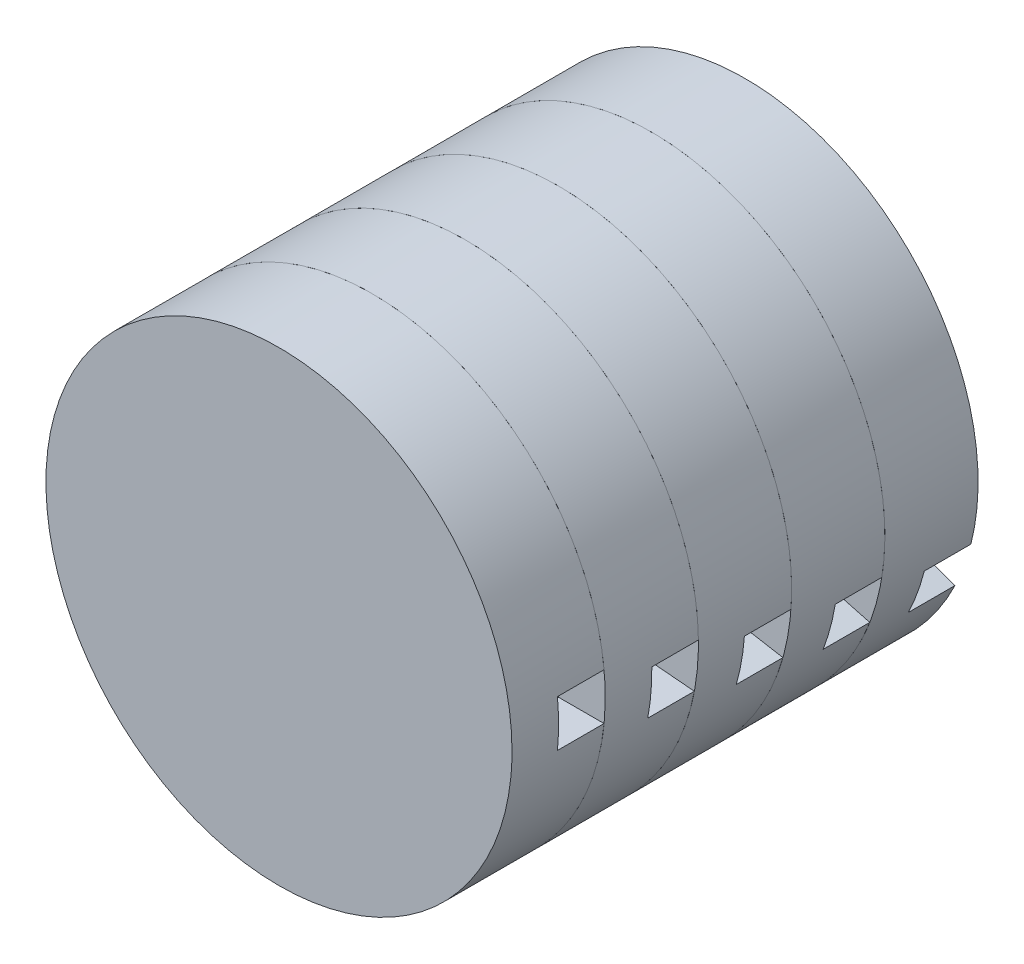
ISO-10303-21;
HEADER;
FILE_DESCRIPTION(('STEP AP214'),'2;1');
FILE_NAME('part.step','',(''),(''),'','','');
FILE_SCHEMA(('AUTOMOTIVE_DESIGN { 1 0 10303 214 1 1 1 1 }'));
ENDSEC;
DATA;
#1=APPLICATION_CONTEXT('core data for automotive mechanical design processes');
#2=APPLICATION_PROTOCOL_DEFINITION('international standard','automotive_design',2000,#1);
#3=PRODUCT_CONTEXT('',#1,'mechanical');
#4=PRODUCT('Part','Part','',(#3));
#5=PRODUCT_RELATED_PRODUCT_CATEGORY('part','',(#4));
#6=PRODUCT_DEFINITION_FORMATION('','',#4);
#7=PRODUCT_DEFINITION_CONTEXT('part definition',#1,'design');
#8=PRODUCT_DEFINITION('design','',#6,#7);
#9=PRODUCT_DEFINITION_SHAPE('','',#8);
#10=(LENGTH_UNIT() NAMED_UNIT(*) SI_UNIT(.MILLI.,.METRE.));
#11=(NAMED_UNIT(*) PLANE_ANGLE_UNIT() SI_UNIT($,.RADIAN.));
#12=(NAMED_UNIT(*) SI_UNIT($,.STERADIAN.) SOLID_ANGLE_UNIT());
#13=UNCERTAINTY_MEASURE_WITH_UNIT(LENGTH_MEASURE(1.E-05),#10,'distance_accuracy_value','');
#14=(GEOMETRIC_REPRESENTATION_CONTEXT(3) GLOBAL_UNCERTAINTY_ASSIGNED_CONTEXT((#13)) GLOBAL_UNIT_ASSIGNED_CONTEXT((#10,
#11,#12)) REPRESENTATION_CONTEXT('',''));
#15=CARTESIAN_POINT('',(0.,0.,0.));
#16=DIRECTION('',(0.,0.,1.));
#17=DIRECTION('',(1.,0.,0.));
#18=AXIS2_PLACEMENT_3D('',#15,#16,#17);
#19=CARTESIAN_POINT('',(0.,0.,20.));
#20=DIRECTION('',(0.,0.,-1.));
#21=DIRECTION('',(-1.,0.,0.));
#22=AXIS2_PLACEMENT_3D('',#19,#20,#21);
#23=CYLINDRICAL_SURFACE('',#22,50.);
#24=CARTESIAN_POINT('',(0.,0.,0.));
#25=DIRECTION('',(0.,0.,1.));
#26=DIRECTION('',(1.,0.,0.));
#27=AXIS2_PLACEMENT_3D('',#24,#25,#26);
#28=CIRCLE('',#27,50.);
#29=CARTESIAN_POINT('',(49.749371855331,5.,0.));
#30=VERTEX_POINT('',#29);
#31=CARTESIAN_POINT('',(49.749371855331,-5.,0.));
#32=VERTEX_POINT('',#31);
#33=EDGE_CURVE('P0_E84',#30,#32,#28,.T.);
#34=ORIENTED_EDGE('',*,*,#33,.T.);
#35=DIRECTION('',(0.,0.,-1.));
#36=VECTOR('',#35,1.);
#37=CARTESIAN_POINT('',(49.749371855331,-5.,20.));
#38=LINE('',#37,#36);
#39=CARTESIAN_POINT('',(49.749371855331,-5.,10.));
#40=VERTEX_POINT('',#39);
#41=EDGE_CURVE('P0_E58',#32,#40,#38,.F.);
#42=ORIENTED_EDGE('',*,*,#41,.T.);
#43=CARTESIAN_POINT('',(0.,0.,10.));
#44=DIRECTION('',(0.,0.,1.));
#45=DIRECTION('',(1.,0.,0.));
#46=AXIS2_PLACEMENT_3D('',#43,#44,#45);
#47=CIRCLE('',#46,50.);
#48=CARTESIAN_POINT('',(49.749371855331,5.,10.));
#49=VERTEX_POINT('',#48);
#50=EDGE_CURVE('P0_E10',#40,#49,#47,.T.);
#51=ORIENTED_EDGE('',*,*,#50,.T.);
#52=DIRECTION('',(0.,0.,-1.));
#53=VECTOR('',#52,1.);
#54=CARTESIAN_POINT('',(49.749371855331,5.,20.));
#55=LINE('',#54,#53);
#56=EDGE_CURVE('P0_E66',#49,#30,#55,.T.);
#57=ORIENTED_EDGE('',*,*,#56,.T.);
#58=EDGE_LOOP('',(#34,#42,#51,#57));
#59=FACE_BOUND('',#58,.T.);
#60=CARTESIAN_POINT('',(0.,0.,20.));
#61=DIRECTION('',(0.,0.,1.));
#62=DIRECTION('',(1.,0.,0.));
#63=AXIS2_PLACEMENT_3D('',#60,#61,#62);
#64=CIRCLE('',#63,50.);
#65=CARTESIAN_POINT('',(50.,0.,20.));
#66=VERTEX_POINT('',#65);
#67=EDGE_CURVE('P0_E62',#66,#66,#64,.T.);
#68=ORIENTED_EDGE('',*,*,#67,.F.);
#69=EDGE_LOOP('',(#68));
#70=FACE_BOUND('',#69,.T.);
#71=ADVANCED_FACE('P0_F15',(#59,#70),#23,.T.);
#72=CARTESIAN_POINT('',(0.,0.,20.));
#73=DIRECTION('',(0.,0.,1.));
#74=DIRECTION('',(1.,0.,0.));
#75=AXIS2_PLACEMENT_3D('',#72,#73,#74);
#76=PLANE('',#75);
#77=ORIENTED_EDGE('',*,*,#67,.T.);
#78=EDGE_LOOP('',(#77));
#79=FACE_BOUND('',#78,.T.);
#80=ADVANCED_FACE('P0_F89',(#79),#76,.T.);
#81=CARTESIAN_POINT('',(0.,0.,0.));
#82=DIRECTION('',(0.,0.,1.));
#83=DIRECTION('',(1.,0.,0.));
#84=AXIS2_PLACEMENT_3D('',#81,#82,#83);
#85=PLANE('',#84);
#86=DIRECTION('',(0.,1.,0.));
#87=VECTOR('',#86,1.);
#88=CARTESIAN_POINT('',(40.,5.,0.));
#89=LINE('',#88,#87);
#90=CARTESIAN_POINT('',(40.,-5.,0.));
#91=VERTEX_POINT('',#90);
#92=CARTESIAN_POINT('',(40.,5.,0.));
#93=VERTEX_POINT('',#92);
#94=EDGE_CURVE('P0_E29',#91,#93,#89,.T.);
#95=ORIENTED_EDGE('',*,*,#94,.F.);
#96=DIRECTION('',(1.,0.,0.));
#97=VECTOR('',#96,1.);
#98=CARTESIAN_POINT('',(0.,-5.,0.));
#99=LINE('',#98,#97);
#100=EDGE_CURVE('P0_E22',#91,#32,#99,.T.);
#101=ORIENTED_EDGE('',*,*,#100,.T.);
#102=ORIENTED_EDGE('',*,*,#33,.F.);
#103=DIRECTION('',(1.,0.,0.));
#104=VECTOR('',#103,1.);
#105=CARTESIAN_POINT('',(40.,5.,0.));
#106=LINE('',#105,#104);
#107=EDGE_CURVE('P0_E71',#93,#30,#106,.T.);
#108=ORIENTED_EDGE('',*,*,#107,.F.);
#109=EDGE_LOOP('',(#95,#101,#102,#108));
#110=FACE_BOUND('',#109,.T.);
#111=ADVANCED_FACE('P0_F70',(#110),#85,.F.);
#112=CARTESIAN_POINT('',(40.,-5.,10.));
#113=DIRECTION('',(0.,0.,1.));
#114=DIRECTION('',(1.,0.,0.));
#115=AXIS2_PLACEMENT_3D('',#112,#113,#114);
#116=PLANE('',#115);
#117=ORIENTED_EDGE('',*,*,#50,.F.);
#118=DIRECTION('',(-1.,0.,0.));
#119=VECTOR('',#118,1.);
#120=CARTESIAN_POINT('',(40.,-5.,10.));
#121=LINE('',#120,#119);
#122=CARTESIAN_POINT('',(40.,-5.,10.));
#123=VERTEX_POINT('',#122);
#124=EDGE_CURVE('P0_E78',#40,#123,#121,.T.);
#125=ORIENTED_EDGE('',*,*,#124,.T.);
#126=DIRECTION('',(0.,1.,0.));
#127=VECTOR('',#126,1.);
#128=CARTESIAN_POINT('',(40.,5.,10.));
#129=LINE('',#128,#127);
#130=CARTESIAN_POINT('',(40.,5.,10.));
#131=VERTEX_POINT('',#130);
#132=EDGE_CURVE('P0_E65',#123,#131,#129,.T.);
#133=ORIENTED_EDGE('',*,*,#132,.T.);
#134=DIRECTION('',(1.,0.,0.));
#135=VECTOR('',#134,1.);
#136=CARTESIAN_POINT('',(40.,5.,10.));
#137=LINE('',#136,#135);
#138=EDGE_CURVE('P0_E76',#131,#49,#137,.T.);
#139=ORIENTED_EDGE('',*,*,#138,.T.);
#140=EDGE_LOOP('',(#117,#125,#133,#139));
#141=FACE_BOUND('',#140,.T.);
#142=ADVANCED_FACE('P0_F100',(#141),#116,.F.);
#143=CARTESIAN_POINT('',(40.,-5.,10.));
#144=DIRECTION('',(0.,-1.,0.));
#145=DIRECTION('',(0.,0.,-1.));
#146=AXIS2_PLACEMENT_3D('',#143,#144,#145);
#147=PLANE('',#146);
#148=ORIENTED_EDGE('',*,*,#100,.F.);
#149=DIRECTION('',(0.,0.,-1.));
#150=VECTOR('',#149,1.);
#151=CARTESIAN_POINT('',(40.,-5.,10.));
#152=LINE('',#151,#150);
#153=EDGE_CURVE('P0_E55',#123,#91,#152,.T.);
#154=ORIENTED_EDGE('',*,*,#153,.F.);
#155=ORIENTED_EDGE('',*,*,#124,.F.);
#156=ORIENTED_EDGE('',*,*,#41,.F.);
#157=EDGE_LOOP('',(#148,#154,#155,#156));
#158=FACE_BOUND('',#157,.T.);
#159=ADVANCED_FACE('P0_F54',(#158),#147,.F.);
#160=CARTESIAN_POINT('',(40.,5.,10.));
#161=DIRECTION('',(0.,1.,0.));
#162=DIRECTION('',(-1.,0.,0.));
#163=AXIS2_PLACEMENT_3D('',#160,#161,#162);
#164=PLANE('',#163);
#165=ORIENTED_EDGE('',*,*,#138,.F.);
#166=DIRECTION('',(0.,0.,-1.));
#167=VECTOR('',#166,1.);
#168=CARTESIAN_POINT('',(40.,5.,10.));
#169=LINE('',#168,#167);
#170=EDGE_CURVE('P0_E67',#131,#93,#169,.T.);
#171=ORIENTED_EDGE('',*,*,#170,.T.);
#172=ORIENTED_EDGE('',*,*,#107,.T.);
#173=ORIENTED_EDGE('',*,*,#56,.F.);
#174=EDGE_LOOP('',(#165,#171,#172,#173));
#175=FACE_BOUND('',#174,.T.);
#176=ADVANCED_FACE('P0_F99',(#175),#164,.F.);
#177=CARTESIAN_POINT('',(40.,5.,10.));
#178=DIRECTION('',(-1.,0.,0.));
#179=DIRECTION('',(0.,0.,1.));
#180=AXIS2_PLACEMENT_3D('',#177,#178,#179);
#181=PLANE('',#180);
#182=ORIENTED_EDGE('',*,*,#94,.T.);
#183=ORIENTED_EDGE('',*,*,#170,.F.);
#184=ORIENTED_EDGE('',*,*,#132,.F.);
#185=ORIENTED_EDGE('',*,*,#153,.T.);
#186=EDGE_LOOP('',(#182,#183,#184,#185));
#187=FACE_BOUND('',#186,.T.);
#188=ADVANCED_FACE('P0_F63',(#187),#181,.F.);
#189=CLOSED_SHELL('',(#71,#80,#111,#142,#159,#176,#188));
#190=MANIFOLD_SOLID_BREP('P0_B1',#189);
#191=CARTESIAN_POINT('',(0.,0.,-40.));
#192=DIRECTION('',(0.,0.,-1.));
#193=DIRECTION('',(-0.965925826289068,0.258819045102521,0.));
#194=AXIS2_PLACEMENT_3D('',#191,#192,#193);
#195=CYLINDRICAL_SURFACE('',#194,50.);
#196=CARTESIAN_POINT('',(0.,0.,-60.));
#197=DIRECTION('',(0.,0.,1.));
#198=DIRECTION('',(0.965925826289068,-0.258819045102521,0.));
#199=AXIS2_PLACEMENT_3D('',#196,#197,#198);
#200=CIRCLE('',#199,50.);
#201=CARTESIAN_POINT('',(49.3482983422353,-8.04645578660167,-60.));
#202=VERTEX_POINT('',#201);
#203=CARTESIAN_POINT('',(46.7601078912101,-17.7057140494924,-60.));
#204=VERTEX_POINT('',#203);
#205=EDGE_CURVE('P1_E84',#202,#204,#200,.T.);
#206=ORIENTED_EDGE('',*,*,#205,.T.);
#207=DIRECTION('',(0.,0.,-1.));
#208=VECTOR('',#207,1.);
#209=CARTESIAN_POINT('',(46.7601078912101,-17.7057140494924,-40.));
#210=LINE('',#209,#208);
#211=CARTESIAN_POINT('',(46.7601078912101,-17.7057140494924,-50.));
#212=VERTEX_POINT('',#211);
#213=EDGE_CURVE('P1_E58',#204,#212,#210,.F.);
#214=ORIENTED_EDGE('',*,*,#213,.T.);
#215=CARTESIAN_POINT('',(0.,0.,-50.));
#216=DIRECTION('',(0.,0.,1.));
#217=DIRECTION('',(0.965925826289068,-0.258819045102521,0.));
#218=AXIS2_PLACEMENT_3D('',#215,#216,#217);
#219=CIRCLE('',#218,50.);
#220=CARTESIAN_POINT('',(49.3482983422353,-8.04645578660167,-50.));
#221=VERTEX_POINT('',#220);
#222=EDGE_CURVE('P1_E10',#212,#221,#219,.T.);
#223=ORIENTED_EDGE('',*,*,#222,.T.);
#224=DIRECTION('',(0.,0.,-1.));
#225=VECTOR('',#224,1.);
#226=CARTESIAN_POINT('',(49.3482983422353,-8.04645578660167,-40.));
#227=LINE('',#226,#225);
#228=EDGE_CURVE('P1_E66',#221,#202,#227,.T.);
#229=ORIENTED_EDGE('',*,*,#228,.T.);
#230=EDGE_LOOP('',(#206,#214,#223,#229));
#231=FACE_BOUND('',#230,.T.);
#232=CARTESIAN_POINT('',(0.,0.,-40.));
#233=DIRECTION('',(0.,0.,1.));
#234=DIRECTION('',(0.965925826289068,-0.258819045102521,0.));
#235=AXIS2_PLACEMENT_3D('',#232,#233,#234);
#236=CIRCLE('',#235,50.);
#237=CARTESIAN_POINT('',(48.2962913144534,-12.9409522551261,-40.));
#238=VERTEX_POINT('',#237);
#239=EDGE_CURVE('P1_E62',#238,#238,#236,.T.);
#240=ORIENTED_EDGE('',*,*,#239,.F.);
#241=EDGE_LOOP('',(#240));
#242=FACE_BOUND('',#241,.T.);
#243=ADVANCED_FACE('P1_F15',(#231,#242),#195,.T.);
#244=CARTESIAN_POINT('',(0.,0.,-40.));
#245=DIRECTION('',(0.,0.,1.));
#246=DIRECTION('',(0.965925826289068,-0.258819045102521,0.));
#247=AXIS2_PLACEMENT_3D('',#244,#245,#246);
#248=PLANE('',#247);
#249=ORIENTED_EDGE('',*,*,#239,.T.);
#250=EDGE_LOOP('',(#249));
#251=FACE_BOUND('',#250,.T.);
#252=ADVANCED_FACE('P1_F89',(#251),#248,.T.);
#253=CARTESIAN_POINT('',(0.,0.,-60.));
#254=DIRECTION('',(0.,0.,1.));
#255=DIRECTION('',(0.965925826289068,-0.258819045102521,0.));
#256=AXIS2_PLACEMENT_3D('',#253,#254,#255);
#257=PLANE('',#256);
#258=DIRECTION('',(0.258819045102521,0.965925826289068,0.));
#259=VECTOR('',#258,1.);
#260=CARTESIAN_POINT('',(39.9311282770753,-5.52313267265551,-60.));
#261=LINE('',#260,#259);
#262=CARTESIAN_POINT('',(37.3429378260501,-15.1823909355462,-60.));
#263=VERTEX_POINT('',#262);
#264=CARTESIAN_POINT('',(39.9311282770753,-5.52313267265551,-60.));
#265=VERTEX_POINT('',#264);
#266=EDGE_CURVE('P1_E29',#263,#265,#261,.T.);
#267=ORIENTED_EDGE('',*,*,#266,.F.);
#268=DIRECTION('',(0.965925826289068,-0.258819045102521,0.));
#269=VECTOR('',#268,1.);
#270=CARTESIAN_POINT('',(-1.29409522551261,-4.82962913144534,-60.));
#271=LINE('',#270,#269);
#272=EDGE_CURVE('P1_E22',#263,#204,#271,.T.);
#273=ORIENTED_EDGE('',*,*,#272,.T.);
#274=ORIENTED_EDGE('',*,*,#205,.F.);
#275=DIRECTION('',(0.965925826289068,-0.258819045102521,0.));
#276=VECTOR('',#275,1.);
#277=CARTESIAN_POINT('',(39.9311282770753,-5.52313267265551,-60.));
#278=LINE('',#277,#276);
#279=EDGE_CURVE('P1_E71',#265,#202,#278,.T.);
#280=ORIENTED_EDGE('',*,*,#279,.F.);
#281=EDGE_LOOP('',(#267,#273,#274,#280));
#282=FACE_BOUND('',#281,.T.);
#283=ADVANCED_FACE('P1_F70',(#282),#257,.F.);
#284=CARTESIAN_POINT('',(37.3429378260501,-15.1823909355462,-50.));
#285=DIRECTION('',(0.,0.,1.));
#286=DIRECTION('',(0.965925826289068,-0.258819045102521,0.));
#287=AXIS2_PLACEMENT_3D('',#284,#285,#286);
#288=PLANE('',#287);
#289=ORIENTED_EDGE('',*,*,#222,.F.);
#290=DIRECTION('',(-0.965925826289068,0.258819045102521,0.));
#291=VECTOR('',#290,1.);
#292=CARTESIAN_POINT('',(37.3429378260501,-15.1823909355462,-50.));
#293=LINE('',#292,#291);
#294=CARTESIAN_POINT('',(37.3429378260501,-15.1823909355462,-50.));
#295=VERTEX_POINT('',#294);
#296=EDGE_CURVE('P1_E78',#212,#295,#293,.T.);
#297=ORIENTED_EDGE('',*,*,#296,.T.);
#298=DIRECTION('',(0.258819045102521,0.965925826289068,0.));
#299=VECTOR('',#298,1.);
#300=CARTESIAN_POINT('',(39.9311282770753,-5.52313267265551,-50.));
#301=LINE('',#300,#299);
#302=CARTESIAN_POINT('',(39.9311282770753,-5.52313267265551,-50.));
#303=VERTEX_POINT('',#302);
#304=EDGE_CURVE('P1_E65',#295,#303,#301,.T.);
#305=ORIENTED_EDGE('',*,*,#304,.T.);
#306=DIRECTION('',(0.965925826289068,-0.258819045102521,0.));
#307=VECTOR('',#306,1.);
#308=CARTESIAN_POINT('',(39.9311282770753,-5.52313267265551,-50.));
#309=LINE('',#308,#307);
#310=EDGE_CURVE('P1_E76',#303,#221,#309,.T.);
#311=ORIENTED_EDGE('',*,*,#310,.T.);
#312=EDGE_LOOP('',(#289,#297,#305,#311));
#313=FACE_BOUND('',#312,.T.);
#314=ADVANCED_FACE('P1_F100',(#313),#288,.F.);
#315=CARTESIAN_POINT('',(37.3429378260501,-15.1823909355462,-50.));
#316=DIRECTION('',(-0.258819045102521,-0.965925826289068,0.));
#317=DIRECTION('',(0.,0.,-1.));
#318=AXIS2_PLACEMENT_3D('',#315,#316,#317);
#319=PLANE('',#318);
#320=ORIENTED_EDGE('',*,*,#272,.F.);
#321=DIRECTION('',(0.,0.,-1.));
#322=VECTOR('',#321,1.);
#323=CARTESIAN_POINT('',(37.3429378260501,-15.1823909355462,-50.));
#324=LINE('',#323,#322);
#325=EDGE_CURVE('P1_E55',#295,#263,#324,.T.);
#326=ORIENTED_EDGE('',*,*,#325,.F.);
#327=ORIENTED_EDGE('',*,*,#296,.F.);
#328=ORIENTED_EDGE('',*,*,#213,.F.);
#329=EDGE_LOOP('',(#320,#326,#327,#328));
#330=FACE_BOUND('',#329,.T.);
#331=ADVANCED_FACE('P1_F54',(#330),#319,.F.);
#332=CARTESIAN_POINT('',(39.9311282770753,-5.52313267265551,-50.));
#333=DIRECTION('',(0.258819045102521,0.965925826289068,0.));
#334=DIRECTION('',(-0.965925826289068,0.258819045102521,0.));
#335=AXIS2_PLACEMENT_3D('',#332,#333,#334);
#336=PLANE('',#335);
#337=ORIENTED_EDGE('',*,*,#310,.F.);
#338=DIRECTION('',(0.,0.,-1.));
#339=VECTOR('',#338,1.);
#340=CARTESIAN_POINT('',(39.9311282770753,-5.52313267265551,-50.));
#341=LINE('',#340,#339);
#342=EDGE_CURVE('P1_E67',#303,#265,#341,.T.);
#343=ORIENTED_EDGE('',*,*,#342,.T.);
#344=ORIENTED_EDGE('',*,*,#279,.T.);
#345=ORIENTED_EDGE('',*,*,#228,.F.);
#346=EDGE_LOOP('',(#337,#343,#344,#345));
#347=FACE_BOUND('',#346,.T.);
#348=ADVANCED_FACE('P1_F99',(#347),#336,.F.);
#349=CARTESIAN_POINT('',(39.9311282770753,-5.52313267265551,-50.));
#350=DIRECTION('',(-0.965925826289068,0.258819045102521,0.));
#351=DIRECTION('',(0.,0.,1.));
#352=AXIS2_PLACEMENT_3D('',#349,#350,#351);
#353=PLANE('',#352);
#354=ORIENTED_EDGE('',*,*,#266,.T.);
#355=ORIENTED_EDGE('',*,*,#342,.F.);
#356=ORIENTED_EDGE('',*,*,#304,.F.);
#357=ORIENTED_EDGE('',*,*,#325,.T.);
#358=EDGE_LOOP('',(#354,#355,#356,#357));
#359=FACE_BOUND('',#358,.T.);
#360=ADVANCED_FACE('P1_F63',(#359),#353,.F.);
#361=CLOSED_SHELL('',(#243,#252,#283,#314,#331,#348,#360));
#362=MANIFOLD_SOLID_BREP('P1_B1',#361);
#363=CARTESIAN_POINT('',(0.,0.,0.));
#364=DIRECTION('',(0.,0.,-1.));
#365=DIRECTION('',(-0.996194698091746,0.0871557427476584,0.));
#366=AXIS2_PLACEMENT_3D('',#363,#364,#365);
#367=CYLINDRICAL_SURFACE('',#366,50.);
#368=CARTESIAN_POINT('',(0.,0.,-20.));
#369=DIRECTION('',(0.,0.,1.));
#370=DIRECTION('',(0.996194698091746,-0.0871557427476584,0.));
#371=AXIS2_PLACEMENT_3D('',#368,#369,#370);
#372=CIRCLE('',#371,50.);
#373=CARTESIAN_POINT('',(49.9958391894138,0.645030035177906,-20.));
#374=VERTEX_POINT('',#373);
#375=CARTESIAN_POINT('',(49.1242817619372,-9.31691694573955,-20.));
#376=VERTEX_POINT('',#375);
#377=EDGE_CURVE('P2_E84',#374,#376,#372,.T.);
#378=ORIENTED_EDGE('',*,*,#377,.T.);
#379=DIRECTION('',(0.,0.,-1.));
#380=VECTOR('',#379,1.);
#381=CARTESIAN_POINT('',(49.1242817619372,-9.31691694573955,0.));
#382=LINE('',#381,#380);
#383=CARTESIAN_POINT('',(49.1242817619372,-9.31691694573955,-10.));
#384=VERTEX_POINT('',#383);
#385=EDGE_CURVE('P2_E58',#376,#384,#382,.F.);
#386=ORIENTED_EDGE('',*,*,#385,.T.);
#387=CARTESIAN_POINT('',(0.,0.,-10.));
#388=DIRECTION('',(0.,0.,1.));
#389=DIRECTION('',(0.996194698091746,-0.0871557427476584,0.));
#390=AXIS2_PLACEMENT_3D('',#387,#388,#389);
#391=CIRCLE('',#390,50.);
#392=CARTESIAN_POINT('',(49.9958391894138,0.645030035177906,-10.));
#393=VERTEX_POINT('',#392);
#394=EDGE_CURVE('P2_E10',#384,#393,#391,.T.);
#395=ORIENTED_EDGE('',*,*,#394,.T.);
#396=DIRECTION('',(0.,0.,-1.));
#397=VECTOR('',#396,1.);
#398=CARTESIAN_POINT('',(49.9958391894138,0.645030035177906,0.));
#399=LINE('',#398,#397);
#400=EDGE_CURVE('P2_E66',#393,#374,#399,.T.);
#401=ORIENTED_EDGE('',*,*,#400,.T.);
#402=EDGE_LOOP('',(#378,#386,#395,#401));
#403=FACE_BOUND('',#402,.T.);
#404=CARTESIAN_POINT('',(0.,0.,0.));
#405=DIRECTION('',(0.,0.,1.));
#406=DIRECTION('',(0.996194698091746,-0.0871557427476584,0.));
#407=AXIS2_PLACEMENT_3D('',#404,#405,#406);
#408=CIRCLE('',#407,50.);
#409=CARTESIAN_POINT('',(49.8097349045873,-4.35778713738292,0.));
#410=VERTEX_POINT('',#409);
#411=EDGE_CURVE('P2_E62',#410,#410,#408,.T.);
#412=ORIENTED_EDGE('',*,*,#411,.F.);
#413=EDGE_LOOP('',(#412));
#414=FACE_BOUND('',#413,.T.);
#415=ADVANCED_FACE('P2_F15',(#403,#414),#367,.T.);
#416=CARTESIAN_POINT('',(0.,0.,0.));
#417=DIRECTION('',(0.,0.,1.));
#418=DIRECTION('',(0.996194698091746,-0.0871557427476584,0.));
#419=AXIS2_PLACEMENT_3D('',#416,#417,#418);
#420=PLANE('',#419);
#421=ORIENTED_EDGE('',*,*,#411,.T.);
#422=EDGE_LOOP('',(#421));
#423=FACE_BOUND('',#422,.T.);
#424=ADVANCED_FACE('P2_F89',(#423),#420,.T.);
#425=CARTESIAN_POINT('',(0.,0.,-20.));
#426=DIRECTION('',(0.,0.,1.));
#427=DIRECTION('',(0.996194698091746,-0.0871557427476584,0.));
#428=AXIS2_PLACEMENT_3D('',#425,#426,#427);
#429=PLANE('',#428);
#430=DIRECTION('',(0.0871557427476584,0.996194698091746,0.));
#431=VECTOR('',#430,1.);
#432=CARTESIAN_POINT('',(40.2835666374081,1.49474378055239,-20.));
#433=LINE('',#432,#431);
#434=CARTESIAN_POINT('',(39.4120092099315,-8.46720320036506,-20.));
#435=VERTEX_POINT('',#434);
#436=CARTESIAN_POINT('',(40.2835666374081,1.49474378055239,-20.));
#437=VERTEX_POINT('',#436);
#438=EDGE_CURVE('P2_E29',#435,#437,#433,.T.);
#439=ORIENTED_EDGE('',*,*,#438,.F.);
#440=DIRECTION('',(0.996194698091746,-0.0871557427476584,0.));
#441=VECTOR('',#440,1.);
#442=CARTESIAN_POINT('',(-0.435778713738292,-4.98097349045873,-20.));
#443=LINE('',#442,#441);
#444=EDGE_CURVE('P2_E22',#435,#376,#443,.T.);
#445=ORIENTED_EDGE('',*,*,#444,.T.);
#446=ORIENTED_EDGE('',*,*,#377,.F.);
#447=DIRECTION('',(0.996194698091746,-0.087155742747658,0.));
#448=VECTOR('',#447,1.);
#449=CARTESIAN_POINT('',(40.2835666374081,1.49474378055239,-20.));
#450=LINE('',#449,#448);
#451=EDGE_CURVE('P2_E71',#437,#374,#450,.T.);
#452=ORIENTED_EDGE('',*,*,#451,.F.);
#453=EDGE_LOOP('',(#439,#445,#446,#452));
#454=FACE_BOUND('',#453,.T.);
#455=ADVANCED_FACE('P2_F70',(#454),#429,.F.);
#456=CARTESIAN_POINT('',(39.4120092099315,-8.46720320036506,-10.));
#457=DIRECTION('',(0.,0.,1.));
#458=DIRECTION('',(0.996194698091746,-0.0871557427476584,0.));
#459=AXIS2_PLACEMENT_3D('',#456,#457,#458);
#460=PLANE('',#459);
#461=ORIENTED_EDGE('',*,*,#394,.F.);
#462=DIRECTION('',(-0.996194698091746,0.0871557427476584,0.));
#463=VECTOR('',#462,1.);
#464=CARTESIAN_POINT('',(39.4120092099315,-8.46720320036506,-10.));
#465=LINE('',#464,#463);
#466=CARTESIAN_POINT('',(39.4120092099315,-8.46720320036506,-10.));
#467=VERTEX_POINT('',#466);
#468=EDGE_CURVE('P2_E78',#384,#467,#465,.T.);
#469=ORIENTED_EDGE('',*,*,#468,.T.);
#470=DIRECTION('',(0.0871557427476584,0.996194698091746,0.));
#471=VECTOR('',#470,1.);
#472=CARTESIAN_POINT('',(40.2835666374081,1.49474378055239,-10.));
#473=LINE('',#472,#471);
#474=CARTESIAN_POINT('',(40.2835666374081,1.49474378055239,-10.));
#475=VERTEX_POINT('',#474);
#476=EDGE_CURVE('P2_E65',#467,#475,#473,.T.);
#477=ORIENTED_EDGE('',*,*,#476,.T.);
#478=DIRECTION('',(0.996194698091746,-0.087155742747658,0.));
#479=VECTOR('',#478,1.);
#480=CARTESIAN_POINT('',(40.2835666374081,1.49474378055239,-10.));
#481=LINE('',#480,#479);
#482=EDGE_CURVE('P2_E76',#475,#393,#481,.T.);
#483=ORIENTED_EDGE('',*,*,#482,.T.);
#484=EDGE_LOOP('',(#461,#469,#477,#483));
#485=FACE_BOUND('',#484,.T.);
#486=ADVANCED_FACE('P2_F100',(#485),#460,.F.);
#487=CARTESIAN_POINT('',(39.4120092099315,-8.46720320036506,-10.));
#488=DIRECTION('',(-0.0871557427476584,-0.996194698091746,0.));
#489=DIRECTION('',(0.,0.,-1.));
#490=AXIS2_PLACEMENT_3D('',#487,#488,#489);
#491=PLANE('',#490);
#492=ORIENTED_EDGE('',*,*,#444,.F.);
#493=DIRECTION('',(0.,0.,-1.));
#494=VECTOR('',#493,1.);
#495=CARTESIAN_POINT('',(39.4120092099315,-8.46720320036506,-10.));
#496=LINE('',#495,#494);
#497=EDGE_CURVE('P2_E55',#467,#435,#496,.T.);
#498=ORIENTED_EDGE('',*,*,#497,.F.);
#499=ORIENTED_EDGE('',*,*,#468,.F.);
#500=ORIENTED_EDGE('',*,*,#385,.F.);
#501=EDGE_LOOP('',(#492,#498,#499,#500));
#502=FACE_BOUND('',#501,.T.);
#503=ADVANCED_FACE('P2_F54',(#502),#491,.F.);
#504=CARTESIAN_POINT('',(40.2835666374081,1.49474378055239,-10.));
#505=DIRECTION('',(0.087155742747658,0.996194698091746,0.));
#506=DIRECTION('',(-0.996194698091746,0.087155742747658,0.));
#507=AXIS2_PLACEMENT_3D('',#504,#505,#506);
#508=PLANE('',#507);
#509=ORIENTED_EDGE('',*,*,#482,.F.);
#510=DIRECTION('',(0.,0.,-1.));
#511=VECTOR('',#510,1.);
#512=CARTESIAN_POINT('',(40.2835666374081,1.49474378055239,-10.));
#513=LINE('',#512,#511);
#514=EDGE_CURVE('P2_E67',#475,#437,#513,.T.);
#515=ORIENTED_EDGE('',*,*,#514,.T.);
#516=ORIENTED_EDGE('',*,*,#451,.T.);
#517=ORIENTED_EDGE('',*,*,#400,.F.);
#518=EDGE_LOOP('',(#509,#515,#516,#517));
#519=FACE_BOUND('',#518,.T.);
#520=ADVANCED_FACE('P2_F99',(#519),#508,.F.);
#521=CARTESIAN_POINT('',(40.2835666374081,1.49474378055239,-10.));
#522=DIRECTION('',(-0.996194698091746,0.0871557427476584,0.));
#523=DIRECTION('',(0.,0.,1.));
#524=AXIS2_PLACEMENT_3D('',#521,#522,#523);
#525=PLANE('',#524);
#526=ORIENTED_EDGE('',*,*,#438,.T.);
#527=ORIENTED_EDGE('',*,*,#514,.F.);
#528=ORIENTED_EDGE('',*,*,#476,.F.);
#529=ORIENTED_EDGE('',*,*,#497,.T.);
#530=EDGE_LOOP('',(#526,#527,#528,#529));
#531=FACE_BOUND('',#530,.T.);
#532=ADVANCED_FACE('P2_F63',(#531),#525,.F.);
#533=CLOSED_SHELL('',(#415,#424,#455,#486,#503,#520,#532));
#534=MANIFOLD_SOLID_BREP('P2_B1',#533);
#535=CARTESIAN_POINT('',(0.,0.,-60.));
#536=DIRECTION('',(0.,0.,-1.));
#537=DIRECTION('',(-0.939692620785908,0.34202014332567,0.));
#538=AXIS2_PLACEMENT_3D('',#535,#536,#537);
#539=CYLINDRICAL_SURFACE('',#538,50.);
#540=CARTESIAN_POINT('',(0.,0.,-80.));
#541=DIRECTION('',(0.,0.,1.));
#542=DIRECTION('',(0.939692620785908,-0.34202014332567,0.));
#543=AXIS2_PLACEMENT_3D('',#540,#541,#542);
#544=CIRCLE('',#543,50.);
#545=CARTESIAN_POINT('',(48.459218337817,-12.3168241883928,-80.));
#546=VERTEX_POINT('',#545);
#547=CARTESIAN_POINT('',(45.0390169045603,-21.7137503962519,-80.));
#548=VERTEX_POINT('',#547);
#549=EDGE_CURVE('P3_E84',#546,#548,#544,.T.);
#550=ORIENTED_EDGE('',*,*,#549,.T.);
#551=DIRECTION('',(0.,0.,-1.));
#552=VECTOR('',#551,1.);
#553=CARTESIAN_POINT('',(45.0390169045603,-21.7137503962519,-60.));
#554=LINE('',#553,#552);
#555=CARTESIAN_POINT('',(45.0390169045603,-21.7137503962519,-70.));
#556=VERTEX_POINT('',#555);
#557=EDGE_CURVE('P3_E58',#548,#556,#554,.F.);
#558=ORIENTED_EDGE('',*,*,#557,.T.);
#559=CARTESIAN_POINT('',(0.,0.,-70.));
#560=DIRECTION('',(0.,0.,1.));
#561=DIRECTION('',(0.939692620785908,-0.34202014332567,0.));
#562=AXIS2_PLACEMENT_3D('',#559,#560,#561);
#563=CIRCLE('',#562,50.);
#564=CARTESIAN_POINT('',(48.459218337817,-12.3168241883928,-70.));
#565=VERTEX_POINT('',#564);
#566=EDGE_CURVE('P3_E10',#556,#565,#563,.T.);
#567=ORIENTED_EDGE('',*,*,#566,.T.);
#568=DIRECTION('',(0.,0.,-1.));
#569=VECTOR('',#568,1.);
#570=CARTESIAN_POINT('',(48.459218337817,-12.3168241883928,-60.));
#571=LINE('',#570,#569);
#572=EDGE_CURVE('P3_E66',#565,#546,#571,.T.);
#573=ORIENTED_EDGE('',*,*,#572,.T.);
#574=EDGE_LOOP('',(#550,#558,#567,#573));
#575=FACE_BOUND('',#574,.T.);
#576=CARTESIAN_POINT('',(0.,0.,-60.));
#577=DIRECTION('',(0.,0.,1.));
#578=DIRECTION('',(0.939692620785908,-0.34202014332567,0.));
#579=AXIS2_PLACEMENT_3D('',#576,#577,#578);
#580=CIRCLE('',#579,50.);
#581=CARTESIAN_POINT('',(46.9846310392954,-17.1010071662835,-60.));
#582=VERTEX_POINT('',#581);
#583=EDGE_CURVE('P3_E62',#582,#582,#580,.T.);
#584=ORIENTED_EDGE('',*,*,#583,.F.);
#585=EDGE_LOOP('',(#584));
#586=FACE_BOUND('',#585,.T.);
#587=ADVANCED_FACE('P3_F15',(#575,#586),#539,.T.);
#588=CARTESIAN_POINT('',(0.,0.,-60.));
#589=DIRECTION('',(0.,0.,1.));
#590=DIRECTION('',(0.939692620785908,-0.34202014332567,0.));
#591=AXIS2_PLACEMENT_3D('',#588,#589,#590);
#592=PLANE('',#591);
#593=ORIENTED_EDGE('',*,*,#583,.T.);
#594=EDGE_LOOP('',(#593));
#595=FACE_BOUND('',#594,.T.);
#596=ADVANCED_FACE('P3_F89',(#595),#592,.T.);
#597=CARTESIAN_POINT('',(0.,0.,-80.));
#598=DIRECTION('',(0.,0.,1.));
#599=DIRECTION('',(0.939692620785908,-0.34202014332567,0.));
#600=AXIS2_PLACEMENT_3D('',#597,#598,#599);
#601=PLANE('',#600);
#602=DIRECTION('',(0.34202014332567,0.939692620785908,0.));
#603=VECTOR('',#602,1.);
#604=CARTESIAN_POINT('',(39.2978055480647,-8.98234262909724,-80.));
#605=LINE('',#604,#603);
#606=CARTESIAN_POINT('',(35.877604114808,-18.3792688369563,-80.));
#607=VERTEX_POINT('',#606);
#608=CARTESIAN_POINT('',(39.2978055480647,-8.98234262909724,-80.));
#609=VERTEX_POINT('',#608);
#610=EDGE_CURVE('P3_E29',#607,#609,#605,.T.);
#611=ORIENTED_EDGE('',*,*,#610,.F.);
#612=DIRECTION('',(0.939692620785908,-0.34202014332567,0.));
#613=VECTOR('',#612,1.);
#614=CARTESIAN_POINT('',(-1.71010071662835,-4.69846310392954,-80.));
#615=LINE('',#614,#613);
#616=EDGE_CURVE('P3_E22',#607,#548,#615,.T.);
#617=ORIENTED_EDGE('',*,*,#616,.T.);
#618=ORIENTED_EDGE('',*,*,#549,.F.);
#619=DIRECTION('',(0.939692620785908,-0.342020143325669,0.));
#620=VECTOR('',#619,1.);
#621=CARTESIAN_POINT('',(39.2978055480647,-8.98234262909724,-80.));
#622=LINE('',#621,#620);
#623=EDGE_CURVE('P3_E71',#609,#546,#622,.T.);
#624=ORIENTED_EDGE('',*,*,#623,.F.);
#625=EDGE_LOOP('',(#611,#617,#618,#624));
#626=FACE_BOUND('',#625,.T.);
#627=ADVANCED_FACE('P3_F70',(#626),#601,.F.);
#628=CARTESIAN_POINT('',(35.877604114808,-18.3792688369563,-70.));
#629=DIRECTION('',(0.,0.,1.));
#630=DIRECTION('',(0.939692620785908,-0.34202014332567,0.));
#631=AXIS2_PLACEMENT_3D('',#628,#629,#630);
#632=PLANE('',#631);
#633=ORIENTED_EDGE('',*,*,#566,.F.);
#634=DIRECTION('',(-0.939692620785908,0.34202014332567,0.));
#635=VECTOR('',#634,1.);
#636=CARTESIAN_POINT('',(35.877604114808,-18.3792688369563,-70.));
#637=LINE('',#636,#635);
#638=CARTESIAN_POINT('',(35.877604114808,-18.3792688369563,-70.));
#639=VERTEX_POINT('',#638);
#640=EDGE_CURVE('P3_E78',#556,#639,#637,.T.);
#641=ORIENTED_EDGE('',*,*,#640,.T.);
#642=DIRECTION('',(0.34202014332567,0.939692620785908,0.));
#643=VECTOR('',#642,1.);
#644=CARTESIAN_POINT('',(39.2978055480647,-8.98234262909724,-70.));
#645=LINE('',#644,#643);
#646=CARTESIAN_POINT('',(39.2978055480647,-8.98234262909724,-70.));
#647=VERTEX_POINT('',#646);
#648=EDGE_CURVE('P3_E65',#639,#647,#645,.T.);
#649=ORIENTED_EDGE('',*,*,#648,.T.);
#650=DIRECTION('',(0.939692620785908,-0.342020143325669,0.));
#651=VECTOR('',#650,1.);
#652=CARTESIAN_POINT('',(39.2978055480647,-8.98234262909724,-70.));
#653=LINE('',#652,#651);
#654=EDGE_CURVE('P3_E76',#647,#565,#653,.T.);
#655=ORIENTED_EDGE('',*,*,#654,.T.);
#656=EDGE_LOOP('',(#633,#641,#649,#655));
#657=FACE_BOUND('',#656,.T.);
#658=ADVANCED_FACE('P3_F100',(#657),#632,.F.);
#659=CARTESIAN_POINT('',(35.877604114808,-18.3792688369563,-70.));
#660=DIRECTION('',(-0.34202014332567,-0.939692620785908,0.));
#661=DIRECTION('',(0.,0.,-1.));
#662=AXIS2_PLACEMENT_3D('',#659,#660,#661);
#663=PLANE('',#662);
#664=ORIENTED_EDGE('',*,*,#616,.F.);
#665=DIRECTION('',(0.,0.,-1.));
#666=VECTOR('',#665,1.);
#667=CARTESIAN_POINT('',(35.877604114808,-18.3792688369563,-70.));
#668=LINE('',#667,#666);
#669=EDGE_CURVE('P3_E55',#639,#607,#668,.T.);
#670=ORIENTED_EDGE('',*,*,#669,.F.);
#671=ORIENTED_EDGE('',*,*,#640,.F.);
#672=ORIENTED_EDGE('',*,*,#557,.F.);
#673=EDGE_LOOP('',(#664,#670,#671,#672));
#674=FACE_BOUND('',#673,.T.);
#675=ADVANCED_FACE('P3_F54',(#674),#663,.F.);
#676=CARTESIAN_POINT('',(39.2978055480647,-8.98234262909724,-70.));
#677=DIRECTION('',(0.342020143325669,0.939692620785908,0.));
#678=DIRECTION('',(-0.939692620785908,0.342020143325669,0.));
#679=AXIS2_PLACEMENT_3D('',#676,#677,#678);
#680=PLANE('',#679);
#681=ORIENTED_EDGE('',*,*,#654,.F.);
#682=DIRECTION('',(0.,0.,-1.));
#683=VECTOR('',#682,1.);
#684=CARTESIAN_POINT('',(39.2978055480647,-8.98234262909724,-70.));
#685=LINE('',#684,#683);
#686=EDGE_CURVE('P3_E67',#647,#609,#685,.T.);
#687=ORIENTED_EDGE('',*,*,#686,.T.);
#688=ORIENTED_EDGE('',*,*,#623,.T.);
#689=ORIENTED_EDGE('',*,*,#572,.F.);
#690=EDGE_LOOP('',(#681,#687,#688,#689));
#691=FACE_BOUND('',#690,.T.);
#692=ADVANCED_FACE('P3_F99',(#691),#680,.F.);
#693=CARTESIAN_POINT('',(39.2978055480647,-8.98234262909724,-70.));
#694=DIRECTION('',(-0.939692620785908,0.34202014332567,0.));
#695=DIRECTION('',(0.,0.,1.));
#696=AXIS2_PLACEMENT_3D('',#693,#694,#695);
#697=PLANE('',#696);
#698=ORIENTED_EDGE('',*,*,#610,.T.);
#699=ORIENTED_EDGE('',*,*,#686,.F.);
#700=ORIENTED_EDGE('',*,*,#648,.F.);
#701=ORIENTED_EDGE('',*,*,#669,.T.);
#702=EDGE_LOOP('',(#698,#699,#700,#701));
#703=FACE_BOUND('',#702,.T.);
#704=ADVANCED_FACE('P3_F63',(#703),#697,.F.);
#705=CLOSED_SHELL('',(#587,#596,#627,#658,#675,#692,#704));
#706=MANIFOLD_SOLID_BREP('P3_B1',#705);
#707=CARTESIAN_POINT('',(0.,0.,-20.));
#708=DIRECTION('',(0.,0.,-1.));
#709=DIRECTION('',(-0.984807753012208,0.173648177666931,0.));
#710=AXIS2_PLACEMENT_3D('',#707,#708,#709);
#711=CYLINDRICAL_SURFACE('',#710,50.);
#712=CARTESIAN_POINT('',(0.,0.,-40.));
#713=DIRECTION('',(0.,0.,1.));
#714=DIRECTION('',(0.984807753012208,-0.173648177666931,0.));
#715=AXIS2_PLACEMENT_3D('',#712,#713,#714);
#716=CIRCLE('',#715,50.);
#717=CARTESIAN_POINT('',(49.861807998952,-3.71484899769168,-40.));
#718=VERTEX_POINT('',#717);
#719=CARTESIAN_POINT('',(48.1253262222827,-13.5629265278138,-40.));
#720=VERTEX_POINT('',#719);
#721=EDGE_CURVE('P4_E84',#718,#720,#716,.T.);
#722=ORIENTED_EDGE('',*,*,#721,.T.);
#723=DIRECTION('',(0.,0.,-1.));
#724=VECTOR('',#723,1.);
#725=CARTESIAN_POINT('',(48.1253262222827,-13.5629265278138,-20.));
#726=LINE('',#725,#724);
#727=CARTESIAN_POINT('',(48.1253262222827,-13.5629265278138,-30.));
#728=VERTEX_POINT('',#727);
#729=EDGE_CURVE('P4_E58',#720,#728,#726,.F.);
#730=ORIENTED_EDGE('',*,*,#729,.T.);
#731=CARTESIAN_POINT('',(0.,0.,-30.));
#732=DIRECTION('',(0.,0.,1.));
#733=DIRECTION('',(0.984807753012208,-0.173648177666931,0.));
#734=AXIS2_PLACEMENT_3D('',#731,#732,#733);
#735=CIRCLE('',#734,50.);
#736=CARTESIAN_POINT('',(49.861807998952,-3.71484899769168,-30.));
#737=VERTEX_POINT('',#736);
#738=EDGE_CURVE('P4_E10',#728,#737,#735,.T.);
#739=ORIENTED_EDGE('',*,*,#738,.T.);
#740=DIRECTION('',(0.,0.,-1.));
#741=VECTOR('',#740,1.);
#742=CARTESIAN_POINT('',(49.861807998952,-3.71484899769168,-20.));
#743=LINE('',#742,#741);
#744=EDGE_CURVE('P4_E66',#737,#718,#743,.T.);
#745=ORIENTED_EDGE('',*,*,#744,.T.);
#746=EDGE_LOOP('',(#722,#730,#739,#745));
#747=FACE_BOUND('',#746,.T.);
#748=CARTESIAN_POINT('',(0.,0.,-20.));
#749=DIRECTION('',(0.,0.,1.));
#750=DIRECTION('',(0.984807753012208,-0.173648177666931,0.));
#751=AXIS2_PLACEMENT_3D('',#748,#749,#750);
#752=CIRCLE('',#751,50.);
#753=CARTESIAN_POINT('',(49.2403876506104,-8.68240888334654,-20.));
#754=VERTEX_POINT('',#753);
#755=EDGE_CURVE('P4_E62',#754,#754,#752,.T.);
#756=ORIENTED_EDGE('',*,*,#755,.F.);
#757=EDGE_LOOP('',(#756));
#758=FACE_BOUND('',#757,.T.);
#759=ADVANCED_FACE('P4_F15',(#747,#758),#711,.T.);
#760=CARTESIAN_POINT('',(0.,0.,-20.));
#761=DIRECTION('',(0.,0.,1.));
#762=DIRECTION('',(0.984807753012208,-0.173648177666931,0.));
#763=AXIS2_PLACEMENT_3D('',#760,#761,#762);
#764=PLANE('',#763);
#765=ORIENTED_EDGE('',*,*,#755,.T.);
#766=EDGE_LOOP('',(#765));
#767=FACE_BOUND('',#766,.T.);
#768=ADVANCED_FACE('P4_F89',(#767),#764,.T.);
#769=CARTESIAN_POINT('',(0.,0.,-40.));
#770=DIRECTION('',(0.,0.,1.));
#771=DIRECTION('',(0.984807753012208,-0.173648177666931,0.));
#772=AXIS2_PLACEMENT_3D('',#769,#770,#771);
#773=PLANE('',#772);
#774=DIRECTION('',(0.173648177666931,0.984807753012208,0.));
#775=VECTOR('',#774,1.);
#776=CARTESIAN_POINT('',(40.260551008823,-2.02188834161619,-40.));
#777=LINE('',#776,#775);
#778=CARTESIAN_POINT('',(38.5240692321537,-11.8699658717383,-40.));
#779=VERTEX_POINT('',#778);
#780=CARTESIAN_POINT('',(40.260551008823,-2.02188834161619,-40.));
#781=VERTEX_POINT('',#780);
#782=EDGE_CURVE('P4_E29',#779,#781,#777,.T.);
#783=ORIENTED_EDGE('',*,*,#782,.F.);
#784=DIRECTION('',(0.984807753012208,-0.173648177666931,0.));
#785=VECTOR('',#784,1.);
#786=CARTESIAN_POINT('',(-0.868240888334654,-4.92403876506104,-40.));
#787=LINE('',#786,#785);
#788=EDGE_CURVE('P4_E22',#779,#720,#787,.T.);
#789=ORIENTED_EDGE('',*,*,#788,.T.);
#790=ORIENTED_EDGE('',*,*,#721,.F.);
#791=DIRECTION('',(0.984807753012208,-0.17364817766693,0.));
#792=VECTOR('',#791,1.);
#793=CARTESIAN_POINT('',(40.260551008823,-2.02188834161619,-40.));
#794=LINE('',#793,#792);
#795=EDGE_CURVE('P4_E71',#781,#718,#794,.T.);
#796=ORIENTED_EDGE('',*,*,#795,.F.);
#797=EDGE_LOOP('',(#783,#789,#790,#796));
#798=FACE_BOUND('',#797,.T.);
#799=ADVANCED_FACE('P4_F70',(#798),#773,.F.);
#800=CARTESIAN_POINT('',(38.5240692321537,-11.8699658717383,-30.));
#801=DIRECTION('',(0.,0.,1.));
#802=DIRECTION('',(0.984807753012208,-0.173648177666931,0.));
#803=AXIS2_PLACEMENT_3D('',#800,#801,#802);
#804=PLANE('',#803);
#805=ORIENTED_EDGE('',*,*,#738,.F.);
#806=DIRECTION('',(-0.984807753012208,0.173648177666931,0.));
#807=VECTOR('',#806,1.);
#808=CARTESIAN_POINT('',(38.5240692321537,-11.8699658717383,-30.));
#809=LINE('',#808,#807);
#810=CARTESIAN_POINT('',(38.5240692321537,-11.8699658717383,-30.));
#811=VERTEX_POINT('',#810);
#812=EDGE_CURVE('P4_E78',#728,#811,#809,.T.);
#813=ORIENTED_EDGE('',*,*,#812,.T.);
#814=DIRECTION('',(0.173648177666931,0.984807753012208,0.));
#815=VECTOR('',#814,1.);
#816=CARTESIAN_POINT('',(40.260551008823,-2.02188834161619,-30.));
#817=LINE('',#816,#815);
#818=CARTESIAN_POINT('',(40.260551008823,-2.02188834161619,-30.));
#819=VERTEX_POINT('',#818);
#820=EDGE_CURVE('P4_E65',#811,#819,#817,.T.);
#821=ORIENTED_EDGE('',*,*,#820,.T.);
#822=DIRECTION('',(0.984807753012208,-0.17364817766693,0.));
#823=VECTOR('',#822,1.);
#824=CARTESIAN_POINT('',(40.260551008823,-2.02188834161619,-30.));
#825=LINE('',#824,#823);
#826=EDGE_CURVE('P4_E76',#819,#737,#825,.T.);
#827=ORIENTED_EDGE('',*,*,#826,.T.);
#828=EDGE_LOOP('',(#805,#813,#821,#827));
#829=FACE_BOUND('',#828,.T.);
#830=ADVANCED_FACE('P4_F100',(#829),#804,.F.);
#831=CARTESIAN_POINT('',(38.5240692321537,-11.8699658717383,-30.));
#832=DIRECTION('',(-0.173648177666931,-0.984807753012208,0.));
#833=DIRECTION('',(0.,0.,-1.));
#834=AXIS2_PLACEMENT_3D('',#831,#832,#833);
#835=PLANE('',#834);
#836=ORIENTED_EDGE('',*,*,#788,.F.);
#837=DIRECTION('',(0.,0.,-1.));
#838=VECTOR('',#837,1.);
#839=CARTESIAN_POINT('',(38.5240692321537,-11.8699658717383,-30.));
#840=LINE('',#839,#838);
#841=EDGE_CURVE('P4_E55',#811,#779,#840,.T.);
#842=ORIENTED_EDGE('',*,*,#841,.F.);
#843=ORIENTED_EDGE('',*,*,#812,.F.);
#844=ORIENTED_EDGE('',*,*,#729,.F.);
#845=EDGE_LOOP('',(#836,#842,#843,#844));
#846=FACE_BOUND('',#845,.T.);
#847=ADVANCED_FACE('P4_F54',(#846),#835,.F.);
#848=CARTESIAN_POINT('',(40.260551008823,-2.02188834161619,-30.));
#849=DIRECTION('',(0.17364817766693,0.984807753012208,0.));
#850=DIRECTION('',(-0.984807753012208,0.17364817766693,0.));
#851=AXIS2_PLACEMENT_3D('',#848,#849,#850);
#852=PLANE('',#851);
#853=ORIENTED_EDGE('',*,*,#826,.F.);
#854=DIRECTION('',(0.,0.,-1.));
#855=VECTOR('',#854,1.);
#856=CARTESIAN_POINT('',(40.260551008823,-2.02188834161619,-30.));
#857=LINE('',#856,#855);
#858=EDGE_CURVE('P4_E67',#819,#781,#857,.T.);
#859=ORIENTED_EDGE('',*,*,#858,.T.);
#860=ORIENTED_EDGE('',*,*,#795,.T.);
#861=ORIENTED_EDGE('',*,*,#744,.F.);
#862=EDGE_LOOP('',(#853,#859,#860,#861));
#863=FACE_BOUND('',#862,.T.);
#864=ADVANCED_FACE('P4_F99',(#863),#852,.F.);
#865=CARTESIAN_POINT('',(40.260551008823,-2.02188834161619,-30.));
#866=DIRECTION('',(-0.984807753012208,0.173648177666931,0.));
#867=DIRECTION('',(0.,0.,1.));
#868=AXIS2_PLACEMENT_3D('',#865,#866,#867);
#869=PLANE('',#868);
#870=ORIENTED_EDGE('',*,*,#782,.T.);
#871=ORIENTED_EDGE('',*,*,#858,.F.);
#872=ORIENTED_EDGE('',*,*,#820,.F.);
#873=ORIENTED_EDGE('',*,*,#841,.T.);
#874=EDGE_LOOP('',(#870,#871,#872,#873));
#875=FACE_BOUND('',#874,.T.);
#876=ADVANCED_FACE('P4_F63',(#875),#869,.F.);
#877=CLOSED_SHELL('',(#759,#768,#799,#830,#847,#864,#876));
#878=MANIFOLD_SOLID_BREP('P4_B1',#877);
#879=ADVANCED_BREP_SHAPE_REPRESENTATION('',(#18,#190,#362,#534,#706,#878),#14);
#880=SHAPE_DEFINITION_REPRESENTATION(#9,#879);
ENDSEC;
END-ISO-10303-21;
